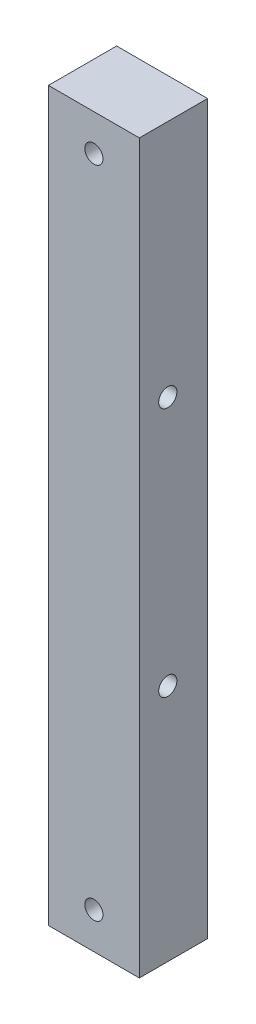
from build123d import *

# Parameters (mm, degrees)
SKETCH_1_W            = 20
SKETCH_1_H            = 15
EXTRUDE_1_DEPTH       = 160
HOLE_WIZARD_4_0_4_1_D = 4
CUT_EXTRUDE_1_REACH   = 163.941
SKETCH_4_R            = 2


with BuildPart() as part:
    # Sketch 1 → Extrude 1 (new body)
    with BuildSketch(Plane(origin=(0, 0, 0), x_dir=(1, 0, 0), z_dir=(0, 1, 0))):
        with Locations((10, 7.5)):
            Rectangle(SKETCH_1_W, SKETCH_1_H)
    extrude(amount=EXTRUDE_1_DEPTH)

    # Hole Wizard 4.0 _4_ _1 (through all)
    with Locations(Plane.ZY):
        with Locations((-6.25, 107.5), (-6.25, 52.5)):
            Hole(HOLE_WIZARD_4_0_4_1_D / 2)

    # Sketch 4 → Cut-Extrude 1 (cut, up to next)
    with BuildSketch(Plane.XY, mode=Mode.PRIVATE) as cut_extrude_1_sk1:
        with Locations((10, 8)):
            Circle(SKETCH_4_R)
    cut_extrude_1_tool1 = extrude(cut_extrude_1_sk1.sketch, amount=-CUT_EXTRUDE_1_REACH, mode=Mode.PRIVATE) & part.part
    # Sketch 4 → Cut-Extrude 1 (cut, up to next)
    with BuildSketch(Plane.XY, mode=Mode.PRIVATE) as cut_extrude_1_sk2:
        with Locations((10, 152)):
            Circle(SKETCH_4_R)
    cut_extrude_1_tool2 = extrude(cut_extrude_1_sk2.sketch, amount=-CUT_EXTRUDE_1_REACH, mode=Mode.PRIVATE) & part.part
    add(cut_extrude_1_tool1.solids().sort_by_distance((10, 8, 0))[0], mode=Mode.SUBTRACT)
    add(cut_extrude_1_tool2.solids().sort_by_distance((10, 152, 0))[0], mode=Mode.SUBTRACT)


solid = part.part
